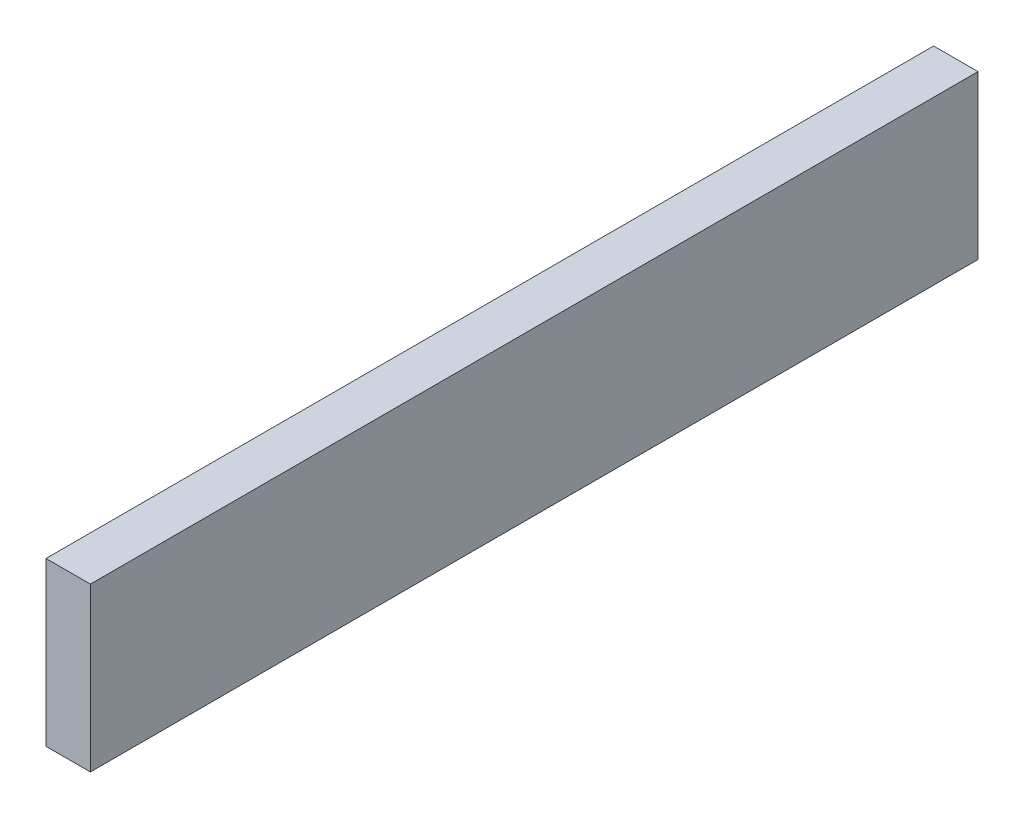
from build123d import *

# Parameters (mm, degrees)
SKETCH2_W           = 38.1
SKETCH2_H           = 139.7
BOSS_EXTRUDE2_DEPTH = 762


with BuildPart() as part:
    # Sketch2 → Boss-Extrude2 (new body)
    with BuildSketch(Plane.XY):
        with Locations((19.05, 69.85)):
            Rectangle(SKETCH2_W, SKETCH2_H)
    extrude(amount=BOSS_EXTRUDE2_DEPTH)


solid = part.part
